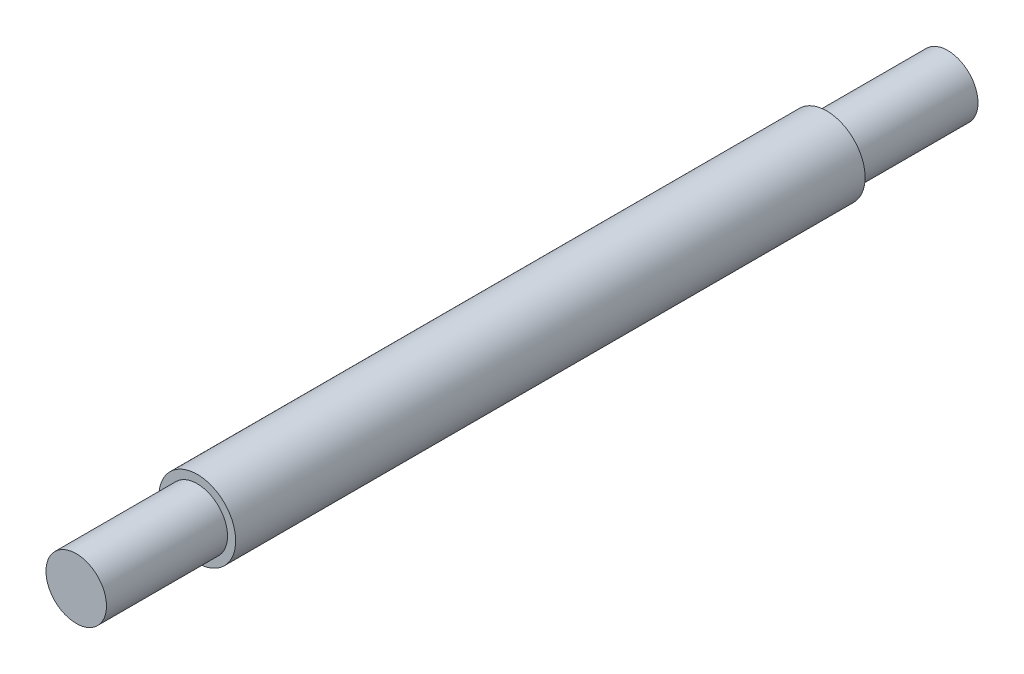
from build123d import *

# Parameters (mm, degrees)
ESBO_O1_R                = 2.5
RESSALTO_EXTRUS_O1_DEPTH = 10
ESBO_O2_R                = 3.175
RESSALTO_EXTRUS_O2_DEPTH = 52
ESBO_O3_R                = 2.5
RESSALTO_EXTRUS_O3_DEPTH = 10


with BuildPart() as part:
    # Esbo_o1 → Ressalto-extrus_o1 (new body)
    with BuildSketch(Plane.XY):
        Circle(ESBO_O1_R)
    extrude(amount=RESSALTO_EXTRUS_O1_DEPTH)

    # Esbo_o2 → Ressalto-extrus_o2 (add)
    with BuildSketch(Plane.XY.offset(10)):
        with Locations(Location((0, 0, 0), (0, 0, 180))):
            Circle(ESBO_O2_R)
    extrude(amount=RESSALTO_EXTRUS_O2_DEPTH)

    # Esbo_o3 → Ressalto-extrus_o3 (add)
    with BuildSketch(Plane.XY.offset(62)):
        Circle(ESBO_O3_R)
    extrude(amount=RESSALTO_EXTRUS_O3_DEPTH)


solid = part.part
